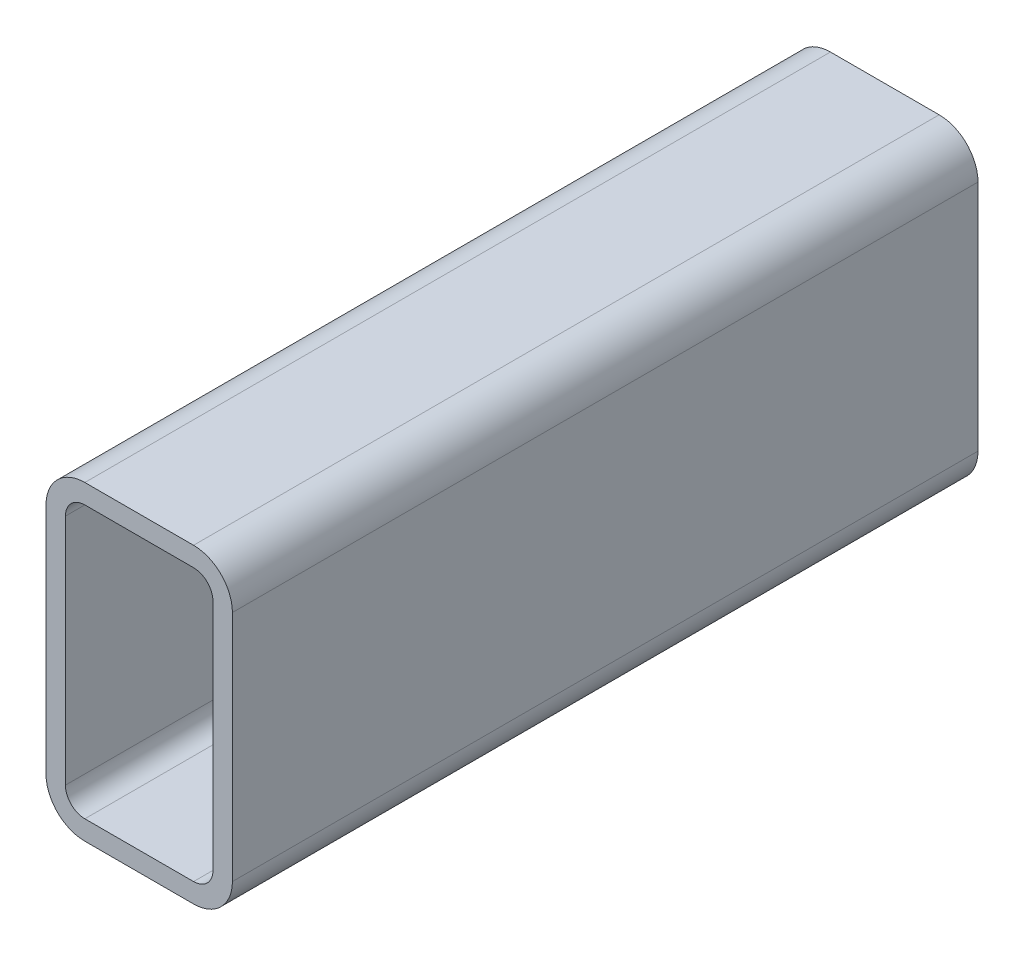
ISO-10303-21;
HEADER;
FILE_DESCRIPTION(('STEP AP214'),'2;1');
FILE_NAME('part.step','',(''),(''),'','','');
FILE_SCHEMA(('AUTOMOTIVE_DESIGN { 1 0 10303 214 1 1 1 1 }'));
ENDSEC;
DATA;
#1=APPLICATION_CONTEXT('core data for automotive mechanical design processes');
#2=APPLICATION_PROTOCOL_DEFINITION('international standard','automotive_design',2000,#1);
#3=PRODUCT_CONTEXT('',#1,'mechanical');
#4=PRODUCT('Part','Part','',(#3));
#5=PRODUCT_RELATED_PRODUCT_CATEGORY('part','',(#4));
#6=PRODUCT_DEFINITION_FORMATION('','',#4);
#7=PRODUCT_DEFINITION_CONTEXT('part definition',#1,'design');
#8=PRODUCT_DEFINITION('design','',#6,#7);
#9=PRODUCT_DEFINITION_SHAPE('','',#8);
#10=(LENGTH_UNIT() NAMED_UNIT(*) SI_UNIT(.MILLI.,.METRE.));
#11=(NAMED_UNIT(*) PLANE_ANGLE_UNIT() SI_UNIT($,.RADIAN.));
#12=(NAMED_UNIT(*) SI_UNIT($,.STERADIAN.) SOLID_ANGLE_UNIT());
#13=UNCERTAINTY_MEASURE_WITH_UNIT(LENGTH_MEASURE(1.E-05),#10,'distance_accuracy_value','');
#14=(GEOMETRIC_REPRESENTATION_CONTEXT(3) GLOBAL_UNCERTAINTY_ASSIGNED_CONTEXT((#13)) GLOBAL_UNIT_ASSIGNED_CONTEXT((#10,
#11,#12)) REPRESENTATION_CONTEXT('',''));
#15=CARTESIAN_POINT('',(0.,0.,0.));
#16=DIRECTION('',(0.,0.,1.));
#17=DIRECTION('',(1.,0.,0.));
#18=AXIS2_PLACEMENT_3D('',#15,#16,#17);
#19=CARTESIAN_POINT('',(18.3641160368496,113.159856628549,304.8));
#20=DIRECTION('',(0.,0.,1.));
#21=DIRECTION('',(1.,0.,0.));
#22=AXIS2_PLACEMENT_3D('',#19,#20,#21);
#23=PLANE('',#22);
#24=CARTESIAN_POINT('',(18.3641160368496,113.159856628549,304.8));
#25=DIRECTION('',(0.,0.,1.));
#26=DIRECTION('',(1.,0.,0.));
#27=AXIS2_PLACEMENT_3D('',#24,#25,#26);
#28=CIRCLE('',#27,15.875);
#29=CARTESIAN_POINT('',(18.3641160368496,129.034856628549,304.8));
#30=VERTEX_POINT('',#29);
#31=CARTESIAN_POINT('',(2.48911603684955,113.159856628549,304.8));
#32=VERTEX_POINT('',#31);
#33=EDGE_CURVE('E211',#30,#32,#28,.T.);
#34=ORIENTED_EDGE('',*,*,#33,.T.);
#35=DIRECTION('',(0.,-1.,0.));
#36=VECTOR('',#35,1.);
#37=CARTESIAN_POINT('',(2.48911603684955,17.9098566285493,304.8));
#38=LINE('',#37,#36);
#39=CARTESIAN_POINT('',(2.48911603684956,17.9098566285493,304.8));
#40=VERTEX_POINT('',#39);
#41=EDGE_CURVE('E214',#32,#40,#38,.T.);
#42=ORIENTED_EDGE('',*,*,#41,.T.);
#43=CARTESIAN_POINT('',(18.3641160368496,17.9098566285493,304.8));
#44=DIRECTION('',(0.,0.,1.));
#45=DIRECTION('',(1.,0.,0.));
#46=AXIS2_PLACEMENT_3D('',#43,#44,#45);
#47=CIRCLE('',#46,15.875);
#48=CARTESIAN_POINT('',(18.3641160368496,2.03485662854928,304.8));
#49=VERTEX_POINT('',#48);
#50=EDGE_CURVE('E217',#40,#49,#47,.T.);
#51=ORIENTED_EDGE('',*,*,#50,.T.);
#52=DIRECTION('',(1.,0.,0.));
#53=VECTOR('',#52,1.);
#54=CARTESIAN_POINT('',(62.8141160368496,2.03485662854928,304.8));
#55=LINE('',#54,#53);
#56=CARTESIAN_POINT('',(62.8141160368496,2.03485662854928,304.8));
#57=VERTEX_POINT('',#56);
#58=EDGE_CURVE('E219',#49,#57,#55,.T.);
#59=ORIENTED_EDGE('',*,*,#58,.T.);
#60=CARTESIAN_POINT('',(62.8141160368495,17.9098566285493,304.8));
#61=DIRECTION('',(0.,0.,1.));
#62=DIRECTION('',(1.,0.,0.));
#63=AXIS2_PLACEMENT_3D('',#60,#61,#62);
#64=CIRCLE('',#63,15.875);
#65=CARTESIAN_POINT('',(78.6891160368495,17.9098566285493,304.8));
#66=VERTEX_POINT('',#65);
#67=EDGE_CURVE('E221',#57,#66,#64,.T.);
#68=ORIENTED_EDGE('',*,*,#67,.T.);
#69=DIRECTION('',(0.,1.,0.));
#70=VECTOR('',#69,1.);
#71=CARTESIAN_POINT('',(78.6891160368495,113.159856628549,304.8));
#72=LINE('',#71,#70);
#73=CARTESIAN_POINT('',(78.6891160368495,113.159856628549,304.8));
#74=VERTEX_POINT('',#73);
#75=EDGE_CURVE('E223',#66,#74,#72,.T.);
#76=ORIENTED_EDGE('',*,*,#75,.T.);
#77=CARTESIAN_POINT('',(62.8141160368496,113.159856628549,304.8));
#78=DIRECTION('',(0.,0.,1.));
#79=DIRECTION('',(1.,0.,0.));
#80=AXIS2_PLACEMENT_3D('',#77,#78,#79);
#81=CIRCLE('',#80,15.875);
#82=CARTESIAN_POINT('',(62.8141160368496,129.034856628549,304.8));
#83=VERTEX_POINT('',#82);
#84=EDGE_CURVE('E225',#74,#83,#81,.T.);
#85=ORIENTED_EDGE('',*,*,#84,.T.);
#86=DIRECTION('',(-1.,0.,0.));
#87=VECTOR('',#86,1.);
#88=CARTESIAN_POINT('',(18.3641160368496,129.034856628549,304.8));
#89=LINE('',#88,#87);
#90=EDGE_CURVE('E227',#83,#30,#89,.T.);
#91=ORIENTED_EDGE('',*,*,#90,.T.);
#92=EDGE_LOOP('',(#34,#42,#51,#59,#68,#76,#85,#91));
#93=FACE_BOUND('',#92,.T.);
#94=DIRECTION('',(0.,-1.,0.));
#95=VECTOR('',#94,1.);
#96=CARTESIAN_POINT('',(10.4266160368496,17.9098566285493,304.8));
#97=LINE('',#96,#95);
#98=CARTESIAN_POINT('',(10.4266160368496,113.159856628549,304.8));
#99=VERTEX_POINT('',#98);
#100=CARTESIAN_POINT('',(10.4266160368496,17.9098566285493,304.8));
#101=VERTEX_POINT('',#100);
#102=EDGE_CURVE('E154',#99,#101,#97,.T.);
#103=ORIENTED_EDGE('',*,*,#102,.F.);
#104=CARTESIAN_POINT('',(18.3641160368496,113.159856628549,304.8));
#105=DIRECTION('',(0.,0.,1.));
#106=DIRECTION('',(1.,0.,0.));
#107=AXIS2_PLACEMENT_3D('',#104,#105,#106);
#108=CIRCLE('',#107,7.93749999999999);
#109=CARTESIAN_POINT('',(18.3641160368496,121.097356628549,304.8));
#110=VERTEX_POINT('',#109);
#111=EDGE_CURVE('E146',#110,#99,#108,.T.);
#112=ORIENTED_EDGE('',*,*,#111,.F.);
#113=DIRECTION('',(-1.,0.,0.));
#114=VECTOR('',#113,1.);
#115=CARTESIAN_POINT('',(18.3641160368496,121.097356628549,304.8));
#116=LINE('',#115,#114);
#117=CARTESIAN_POINT('',(62.8141160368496,121.097356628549,304.8));
#118=VERTEX_POINT('',#117);
#119=EDGE_CURVE('E179',#118,#110,#116,.T.);
#120=ORIENTED_EDGE('',*,*,#119,.F.);
#121=CARTESIAN_POINT('',(62.8141160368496,113.159856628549,304.8));
#122=DIRECTION('',(0.,0.,1.));
#123=DIRECTION('',(1.,0.,0.));
#124=AXIS2_PLACEMENT_3D('',#121,#122,#123);
#125=CIRCLE('',#124,7.93749999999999);
#126=CARTESIAN_POINT('',(70.7516160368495,113.159856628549,304.8));
#127=VERTEX_POINT('',#126);
#128=EDGE_CURVE('E177',#127,#118,#125,.T.);
#129=ORIENTED_EDGE('',*,*,#128,.F.);
#130=DIRECTION('',(0.,1.,0.));
#131=VECTOR('',#130,1.);
#132=CARTESIAN_POINT('',(70.7516160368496,113.159856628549,304.8));
#133=LINE('',#132,#131);
#134=CARTESIAN_POINT('',(70.7516160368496,17.9098566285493,304.8));
#135=VERTEX_POINT('',#134);
#136=EDGE_CURVE('E175',#135,#127,#133,.T.);
#137=ORIENTED_EDGE('',*,*,#136,.F.);
#138=CARTESIAN_POINT('',(62.8141160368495,17.9098566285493,304.8));
#139=DIRECTION('',(0.,0.,1.));
#140=DIRECTION('',(1.,0.,0.));
#141=AXIS2_PLACEMENT_3D('',#138,#139,#140);
#142=CIRCLE('',#141,7.93750000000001);
#143=CARTESIAN_POINT('',(62.8141160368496,9.97235662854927,304.8));
#144=VERTEX_POINT('',#143);
#145=EDGE_CURVE('E173',#144,#135,#142,.T.);
#146=ORIENTED_EDGE('',*,*,#145,.F.);
#147=DIRECTION('',(1.,0.,0.));
#148=VECTOR('',#147,1.);
#149=CARTESIAN_POINT('',(62.8141160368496,9.97235662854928,304.8));
#150=LINE('',#149,#148);
#151=CARTESIAN_POINT('',(18.3641160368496,9.97235662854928,304.8));
#152=VERTEX_POINT('',#151);
#153=EDGE_CURVE('E169',#152,#144,#150,.T.);
#154=ORIENTED_EDGE('',*,*,#153,.F.);
#155=CARTESIAN_POINT('',(18.3641160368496,17.9098566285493,304.8));
#156=DIRECTION('',(0.,0.,1.));
#157=DIRECTION('',(1.,0.,0.));
#158=AXIS2_PLACEMENT_3D('',#155,#156,#157);
#159=CIRCLE('',#158,7.9375);
#160=EDGE_CURVE('E167',#101,#152,#159,.T.);
#161=ORIENTED_EDGE('',*,*,#160,.F.);
#162=EDGE_LOOP('',(#103,#112,#120,#129,#137,#146,#154,#161));
#163=FACE_BOUND('',#162,.T.);
#164=ADVANCED_FACE('F33',(#93,#163),#23,.T.);
#165=CARTESIAN_POINT('',(18.3641160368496,113.159856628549,0.));
#166=DIRECTION('',(0.,0.,1.));
#167=DIRECTION('',(1.,0.,0.));
#168=AXIS2_PLACEMENT_3D('',#165,#166,#167);
#169=PLANE('',#168);
#170=CARTESIAN_POINT('',(18.3641160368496,113.159856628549,0.));
#171=DIRECTION('',(0.,0.,1.));
#172=DIRECTION('',(1.,0.,0.));
#173=AXIS2_PLACEMENT_3D('',#170,#171,#172);
#174=CIRCLE('',#173,15.875);
#175=CARTESIAN_POINT('',(18.3641160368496,129.034856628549,0.));
#176=VERTEX_POINT('',#175);
#177=CARTESIAN_POINT('',(2.48911603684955,113.159856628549,0.));
#178=VERTEX_POINT('',#177);
#179=EDGE_CURVE('E162',#176,#178,#174,.T.);
#180=ORIENTED_EDGE('',*,*,#179,.F.);
#181=DIRECTION('',(-1.,0.,0.));
#182=VECTOR('',#181,1.);
#183=CARTESIAN_POINT('',(18.3641160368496,129.034856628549,0.));
#184=LINE('',#183,#182);
#185=CARTESIAN_POINT('',(62.8141160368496,129.034856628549,0.));
#186=VERTEX_POINT('',#185);
#187=EDGE_CURVE('E215',#186,#176,#184,.T.);
#188=ORIENTED_EDGE('',*,*,#187,.F.);
#189=CARTESIAN_POINT('',(62.8141160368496,113.159856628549,0.));
#190=DIRECTION('',(0.,0.,1.));
#191=DIRECTION('',(1.,0.,0.));
#192=AXIS2_PLACEMENT_3D('',#189,#190,#191);
#193=CIRCLE('',#192,15.875);
#194=CARTESIAN_POINT('',(78.6891160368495,113.159856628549,0.));
#195=VERTEX_POINT('',#194);
#196=EDGE_CURVE('E242',#195,#186,#193,.T.);
#197=ORIENTED_EDGE('',*,*,#196,.F.);
#198=DIRECTION('',(0.,1.,0.));
#199=VECTOR('',#198,1.);
#200=CARTESIAN_POINT('',(78.6891160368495,113.159856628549,0.));
#201=LINE('',#200,#199);
#202=CARTESIAN_POINT('',(78.6891160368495,17.9098566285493,0.));
#203=VERTEX_POINT('',#202);
#204=EDGE_CURVE('E240',#203,#195,#201,.T.);
#205=ORIENTED_EDGE('',*,*,#204,.F.);
#206=CARTESIAN_POINT('',(62.8141160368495,17.9098566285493,0.));
#207=DIRECTION('',(0.,0.,1.));
#208=DIRECTION('',(1.,0.,0.));
#209=AXIS2_PLACEMENT_3D('',#206,#207,#208);
#210=CIRCLE('',#209,15.875);
#211=CARTESIAN_POINT('',(62.8141160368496,2.03485662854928,0.));
#212=VERTEX_POINT('',#211);
#213=EDGE_CURVE('E238',#212,#203,#210,.T.);
#214=ORIENTED_EDGE('',*,*,#213,.F.);
#215=DIRECTION('',(1.,0.,0.));
#216=VECTOR('',#215,1.);
#217=CARTESIAN_POINT('',(62.8141160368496,2.03485662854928,0.));
#218=LINE('',#217,#216);
#219=CARTESIAN_POINT('',(18.3641160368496,2.03485662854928,0.));
#220=VERTEX_POINT('',#219);
#221=EDGE_CURVE('E236',#220,#212,#218,.T.);
#222=ORIENTED_EDGE('',*,*,#221,.F.);
#223=CARTESIAN_POINT('',(18.3641160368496,17.9098566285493,0.));
#224=DIRECTION('',(0.,0.,1.));
#225=DIRECTION('',(1.,0.,0.));
#226=AXIS2_PLACEMENT_3D('',#223,#224,#225);
#227=CIRCLE('',#226,15.875);
#228=CARTESIAN_POINT('',(2.48911603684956,17.9098566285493,0.));
#229=VERTEX_POINT('',#228);
#230=EDGE_CURVE('E234',#229,#220,#227,.T.);
#231=ORIENTED_EDGE('',*,*,#230,.F.);
#232=DIRECTION('',(0.,-1.,0.));
#233=VECTOR('',#232,1.);
#234=CARTESIAN_POINT('',(2.48911603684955,17.9098566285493,0.));
#235=LINE('',#234,#233);
#236=EDGE_CURVE('E232',#178,#229,#235,.T.);
#237=ORIENTED_EDGE('',*,*,#236,.F.);
#238=EDGE_LOOP('',(#180,#188,#197,#205,#214,#222,#231,#237));
#239=FACE_BOUND('',#238,.T.);
#240=CARTESIAN_POINT('',(18.3641160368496,113.159856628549,0.));
#241=DIRECTION('',(0.,0.,1.));
#242=DIRECTION('',(1.,0.,0.));
#243=AXIS2_PLACEMENT_3D('',#240,#241,#242);
#244=CIRCLE('',#243,7.93749999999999);
#245=CARTESIAN_POINT('',(18.3641160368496,121.097356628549,0.));
#246=VERTEX_POINT('',#245);
#247=CARTESIAN_POINT('',(10.4266160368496,113.159856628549,0.));
#248=VERTEX_POINT('',#247);
#249=EDGE_CURVE('E56',#246,#248,#244,.T.);
#250=ORIENTED_EDGE('',*,*,#249,.T.);
#251=DIRECTION('',(0.,-1.,0.));
#252=VECTOR('',#251,1.);
#253=CARTESIAN_POINT('',(10.4266160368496,17.9098566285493,0.));
#254=LINE('',#253,#252);
#255=CARTESIAN_POINT('',(10.4266160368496,17.9098566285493,0.));
#256=VERTEX_POINT('',#255);
#257=EDGE_CURVE('E161',#248,#256,#254,.T.);
#258=ORIENTED_EDGE('',*,*,#257,.T.);
#259=CARTESIAN_POINT('',(18.3641160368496,17.9098566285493,0.));
#260=DIRECTION('',(0.,0.,1.));
#261=DIRECTION('',(1.,0.,0.));
#262=AXIS2_PLACEMENT_3D('',#259,#260,#261);
#263=CIRCLE('',#262,7.9375);
#264=CARTESIAN_POINT('',(18.3641160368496,9.97235662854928,0.));
#265=VERTEX_POINT('',#264);
#266=EDGE_CURVE('E183',#256,#265,#263,.T.);
#267=ORIENTED_EDGE('',*,*,#266,.T.);
#268=DIRECTION('',(1.,0.,0.));
#269=VECTOR('',#268,1.);
#270=CARTESIAN_POINT('',(62.8141160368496,9.97235662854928,0.));
#271=LINE('',#270,#269);
#272=CARTESIAN_POINT('',(62.8141160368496,9.97235662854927,0.));
#273=VERTEX_POINT('',#272);
#274=EDGE_CURVE('E186',#265,#273,#271,.T.);
#275=ORIENTED_EDGE('',*,*,#274,.T.);
#276=CARTESIAN_POINT('',(62.8141160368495,17.9098566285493,0.));
#277=DIRECTION('',(0.,0.,1.));
#278=DIRECTION('',(1.,0.,0.));
#279=AXIS2_PLACEMENT_3D('',#276,#277,#278);
#280=CIRCLE('',#279,7.93750000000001);
#281=CARTESIAN_POINT('',(70.7516160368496,17.9098566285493,0.));
#282=VERTEX_POINT('',#281);
#283=EDGE_CURVE('E189',#273,#282,#280,.T.);
#284=ORIENTED_EDGE('',*,*,#283,.T.);
#285=DIRECTION('',(0.,1.,0.));
#286=VECTOR('',#285,1.);
#287=CARTESIAN_POINT('',(70.7516160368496,113.159856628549,0.));
#288=LINE('',#287,#286);
#289=CARTESIAN_POINT('',(70.7516160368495,113.159856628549,0.));
#290=VERTEX_POINT('',#289);
#291=EDGE_CURVE('E192',#282,#290,#288,.T.);
#292=ORIENTED_EDGE('',*,*,#291,.T.);
#293=CARTESIAN_POINT('',(62.8141160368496,113.159856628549,0.));
#294=DIRECTION('',(0.,0.,1.));
#295=DIRECTION('',(1.,0.,0.));
#296=AXIS2_PLACEMENT_3D('',#293,#294,#295);
#297=CIRCLE('',#296,7.93749999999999);
#298=CARTESIAN_POINT('',(62.8141160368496,121.097356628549,0.));
#299=VERTEX_POINT('',#298);
#300=EDGE_CURVE('E195',#290,#299,#297,.T.);
#301=ORIENTED_EDGE('',*,*,#300,.T.);
#302=DIRECTION('',(-1.,0.,0.));
#303=VECTOR('',#302,1.);
#304=CARTESIAN_POINT('',(18.3641160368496,121.097356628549,0.));
#305=LINE('',#304,#303);
#306=EDGE_CURVE('E155',#299,#246,#305,.T.);
#307=ORIENTED_EDGE('',*,*,#306,.T.);
#308=EDGE_LOOP('',(#250,#258,#267,#275,#284,#292,#301,#307));
#309=FACE_BOUND('',#308,.T.);
#310=ADVANCED_FACE('F272',(#239,#309),#169,.F.);
#311=CARTESIAN_POINT('',(18.3641160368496,113.159856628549,304.8));
#312=DIRECTION('',(0.,0.,-1.));
#313=DIRECTION('',(-1.,0.,0.));
#314=AXIS2_PLACEMENT_3D('',#311,#312,#313);
#315=CYLINDRICAL_SURFACE('',#314,15.875);
#316=ORIENTED_EDGE('',*,*,#179,.T.);
#317=DIRECTION('',(0.,0.,-1.));
#318=VECTOR('',#317,1.);
#319=CARTESIAN_POINT('',(2.48911603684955,113.159856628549,304.8));
#320=LINE('',#319,#318);
#321=EDGE_CURVE('E11',#32,#178,#320,.T.);
#322=ORIENTED_EDGE('',*,*,#321,.F.);
#323=ORIENTED_EDGE('',*,*,#33,.F.);
#324=DIRECTION('',(0.,0.,-1.));
#325=VECTOR('',#324,1.);
#326=CARTESIAN_POINT('',(18.3641160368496,129.034856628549,304.8));
#327=LINE('',#326,#325);
#328=EDGE_CURVE('E229',#30,#176,#327,.T.);
#329=ORIENTED_EDGE('',*,*,#328,.T.);
#330=EDGE_LOOP('',(#316,#322,#323,#329));
#331=FACE_BOUND('',#330,.T.);
#332=ADVANCED_FACE('F35',(#331),#315,.T.);
#333=CARTESIAN_POINT('',(2.48911603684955,17.9098566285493,304.8));
#334=DIRECTION('',(1.,0.,0.));
#335=DIRECTION('',(0.,0.,-1.));
#336=AXIS2_PLACEMENT_3D('',#333,#334,#335);
#337=PLANE('',#336);
#338=ORIENTED_EDGE('',*,*,#236,.T.);
#339=DIRECTION('',(0.,0.,-1.));
#340=VECTOR('',#339,1.);
#341=CARTESIAN_POINT('',(2.48911603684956,17.9098566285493,304.8));
#342=LINE('',#341,#340);
#343=EDGE_CURVE('E41',#40,#229,#342,.T.);
#344=ORIENTED_EDGE('',*,*,#343,.F.);
#345=ORIENTED_EDGE('',*,*,#41,.F.);
#346=ORIENTED_EDGE('',*,*,#321,.T.);
#347=EDGE_LOOP('',(#338,#344,#345,#346));
#348=FACE_BOUND('',#347,.T.);
#349=ADVANCED_FACE('F289',(#348),#337,.F.);
#350=CARTESIAN_POINT('',(18.3641160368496,17.9098566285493,304.8));
#351=DIRECTION('',(0.,0.,-1.));
#352=DIRECTION('',(-1.,0.,0.));
#353=AXIS2_PLACEMENT_3D('',#350,#351,#352);
#354=CYLINDRICAL_SURFACE('',#353,15.875);
#355=ORIENTED_EDGE('',*,*,#230,.T.);
#356=DIRECTION('',(0.,0.,-1.));
#357=VECTOR('',#356,1.);
#358=CARTESIAN_POINT('',(18.3641160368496,2.03485662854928,304.8));
#359=LINE('',#358,#357);
#360=EDGE_CURVE('E259',#49,#220,#359,.T.);
#361=ORIENTED_EDGE('',*,*,#360,.F.);
#362=ORIENTED_EDGE('',*,*,#50,.F.);
#363=ORIENTED_EDGE('',*,*,#343,.T.);
#364=EDGE_LOOP('',(#355,#361,#362,#363));
#365=FACE_BOUND('',#364,.T.);
#366=ADVANCED_FACE('F266',(#365),#354,.T.);
#367=CARTESIAN_POINT('',(62.8141160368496,2.03485662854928,304.8));
#368=DIRECTION('',(0.,1.,0.));
#369=DIRECTION('',(0.,0.,1.));
#370=AXIS2_PLACEMENT_3D('',#367,#368,#369);
#371=PLANE('',#370);
#372=ORIENTED_EDGE('',*,*,#221,.T.);
#373=DIRECTION('',(0.,0.,-1.));
#374=VECTOR('',#373,1.);
#375=CARTESIAN_POINT('',(62.8141160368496,2.03485662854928,304.8));
#376=LINE('',#375,#374);
#377=EDGE_CURVE('E256',#57,#212,#376,.T.);
#378=ORIENTED_EDGE('',*,*,#377,.F.);
#379=ORIENTED_EDGE('',*,*,#58,.F.);
#380=ORIENTED_EDGE('',*,*,#360,.T.);
#381=EDGE_LOOP('',(#372,#378,#379,#380));
#382=FACE_BOUND('',#381,.T.);
#383=ADVANCED_FACE('F278',(#382),#371,.F.);
#384=CARTESIAN_POINT('',(62.8141160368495,17.9098566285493,304.8));
#385=DIRECTION('',(0.,0.,-1.));
#386=DIRECTION('',(-1.,0.,0.));
#387=AXIS2_PLACEMENT_3D('',#384,#385,#386);
#388=CYLINDRICAL_SURFACE('',#387,15.875);
#389=ORIENTED_EDGE('',*,*,#213,.T.);
#390=DIRECTION('',(0.,0.,-1.));
#391=VECTOR('',#390,1.);
#392=CARTESIAN_POINT('',(78.6891160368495,17.9098566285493,304.8));
#393=LINE('',#392,#391);
#394=EDGE_CURVE('E253',#66,#203,#393,.T.);
#395=ORIENTED_EDGE('',*,*,#394,.F.);
#396=ORIENTED_EDGE('',*,*,#67,.F.);
#397=ORIENTED_EDGE('',*,*,#377,.T.);
#398=EDGE_LOOP('',(#389,#395,#396,#397));
#399=FACE_BOUND('',#398,.T.);
#400=ADVANCED_FACE('F282',(#399),#388,.T.);
#401=CARTESIAN_POINT('',(78.6891160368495,113.159856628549,304.8));
#402=DIRECTION('',(-1.,0.,0.));
#403=DIRECTION('',(0.,0.,1.));
#404=AXIS2_PLACEMENT_3D('',#401,#402,#403);
#405=PLANE('',#404);
#406=ORIENTED_EDGE('',*,*,#204,.T.);
#407=DIRECTION('',(0.,0.,-1.));
#408=VECTOR('',#407,1.);
#409=CARTESIAN_POINT('',(78.6891160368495,113.159856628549,304.8));
#410=LINE('',#409,#408);
#411=EDGE_CURVE('E250',#74,#195,#410,.T.);
#412=ORIENTED_EDGE('',*,*,#411,.F.);
#413=ORIENTED_EDGE('',*,*,#75,.F.);
#414=ORIENTED_EDGE('',*,*,#394,.T.);
#415=EDGE_LOOP('',(#406,#412,#413,#414));
#416=FACE_BOUND('',#415,.T.);
#417=ADVANCED_FACE('F302',(#416),#405,.F.);
#418=CARTESIAN_POINT('',(62.8141160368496,113.159856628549,304.8));
#419=DIRECTION('',(0.,0.,-1.));
#420=DIRECTION('',(-1.,0.,0.));
#421=AXIS2_PLACEMENT_3D('',#418,#419,#420);
#422=CYLINDRICAL_SURFACE('',#421,15.875);
#423=ORIENTED_EDGE('',*,*,#196,.T.);
#424=DIRECTION('',(0.,0.,-1.));
#425=VECTOR('',#424,1.);
#426=CARTESIAN_POINT('',(62.8141160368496,129.034856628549,304.8));
#427=LINE('',#426,#425);
#428=EDGE_CURVE('E247',#83,#186,#427,.T.);
#429=ORIENTED_EDGE('',*,*,#428,.F.);
#430=ORIENTED_EDGE('',*,*,#84,.F.);
#431=ORIENTED_EDGE('',*,*,#411,.T.);
#432=EDGE_LOOP('',(#423,#429,#430,#431));
#433=FACE_BOUND('',#432,.T.);
#434=ADVANCED_FACE('F300',(#433),#422,.T.);
#435=CARTESIAN_POINT('',(18.3641160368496,129.034856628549,304.8));
#436=DIRECTION('',(0.,-1.,0.));
#437=DIRECTION('',(0.,0.,-1.));
#438=AXIS2_PLACEMENT_3D('',#435,#436,#437);
#439=PLANE('',#438);
#440=ORIENTED_EDGE('',*,*,#187,.T.);
#441=ORIENTED_EDGE('',*,*,#328,.F.);
#442=ORIENTED_EDGE('',*,*,#90,.F.);
#443=ORIENTED_EDGE('',*,*,#428,.T.);
#444=EDGE_LOOP('',(#440,#441,#442,#443));
#445=FACE_BOUND('',#444,.T.);
#446=ADVANCED_FACE('F295',(#445),#439,.F.);
#447=CARTESIAN_POINT('',(18.3641160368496,113.159856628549,304.8));
#448=DIRECTION('',(0.,0.,-1.));
#449=DIRECTION('',(-1.,0.,0.));
#450=AXIS2_PLACEMENT_3D('',#447,#448,#449);
#451=CYLINDRICAL_SURFACE('',#450,7.93749999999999);
#452=ORIENTED_EDGE('',*,*,#249,.F.);
#453=DIRECTION('',(0.,0.,-1.));
#454=VECTOR('',#453,1.);
#455=CARTESIAN_POINT('',(18.3641160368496,121.097356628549,304.8));
#456=LINE('',#455,#454);
#457=EDGE_CURVE('E150',#110,#246,#456,.T.);
#458=ORIENTED_EDGE('',*,*,#457,.F.);
#459=ORIENTED_EDGE('',*,*,#111,.T.);
#460=DIRECTION('',(0.,0.,-1.));
#461=VECTOR('',#460,1.);
#462=CARTESIAN_POINT('',(10.4266160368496,113.159856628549,304.8));
#463=LINE('',#462,#461);
#464=EDGE_CURVE('E149',#99,#248,#463,.T.);
#465=ORIENTED_EDGE('',*,*,#464,.T.);
#466=EDGE_LOOP('',(#452,#458,#459,#465));
#467=FACE_BOUND('',#466,.T.);
#468=ADVANCED_FACE('F148',(#467),#451,.F.);
#469=CARTESIAN_POINT('',(10.4266160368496,17.9098566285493,304.8));
#470=DIRECTION('',(1.,0.,0.));
#471=DIRECTION('',(0.,0.,-1.));
#472=AXIS2_PLACEMENT_3D('',#469,#470,#471);
#473=PLANE('',#472);
#474=ORIENTED_EDGE('',*,*,#257,.F.);
#475=ORIENTED_EDGE('',*,*,#464,.F.);
#476=ORIENTED_EDGE('',*,*,#102,.T.);
#477=DIRECTION('',(0.,0.,-1.));
#478=VECTOR('',#477,1.);
#479=CARTESIAN_POINT('',(10.4266160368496,17.9098566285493,304.8));
#480=LINE('',#479,#478);
#481=EDGE_CURVE('E163',#101,#256,#480,.T.);
#482=ORIENTED_EDGE('',*,*,#481,.T.);
#483=EDGE_LOOP('',(#474,#475,#476,#482));
#484=FACE_BOUND('',#483,.T.);
#485=ADVANCED_FACE('F158',(#484),#473,.T.);
#486=CARTESIAN_POINT('',(18.3641160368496,17.9098566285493,304.8));
#487=DIRECTION('',(0.,0.,-1.));
#488=DIRECTION('',(-1.,0.,0.));
#489=AXIS2_PLACEMENT_3D('',#486,#487,#488);
#490=CYLINDRICAL_SURFACE('',#489,7.9375);
#491=ORIENTED_EDGE('',*,*,#266,.F.);
#492=ORIENTED_EDGE('',*,*,#481,.F.);
#493=ORIENTED_EDGE('',*,*,#160,.T.);
#494=DIRECTION('',(0.,0.,-1.));
#495=VECTOR('',#494,1.);
#496=CARTESIAN_POINT('',(18.3641160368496,9.97235662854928,304.8));
#497=LINE('',#496,#495);
#498=EDGE_CURVE('E208',#152,#265,#497,.T.);
#499=ORIENTED_EDGE('',*,*,#498,.T.);
#500=EDGE_LOOP('',(#491,#492,#493,#499));
#501=FACE_BOUND('',#500,.T.);
#502=ADVANCED_FACE('F327',(#501),#490,.F.);
#503=CARTESIAN_POINT('',(62.8141160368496,9.97235662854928,304.8));
#504=DIRECTION('',(0.,1.,0.));
#505=DIRECTION('',(0.,0.,1.));
#506=AXIS2_PLACEMENT_3D('',#503,#504,#505);
#507=PLANE('',#506);
#508=ORIENTED_EDGE('',*,*,#274,.F.);
#509=ORIENTED_EDGE('',*,*,#498,.F.);
#510=ORIENTED_EDGE('',*,*,#153,.T.);
#511=DIRECTION('',(0.,0.,-1.));
#512=VECTOR('',#511,1.);
#513=CARTESIAN_POINT('',(62.8141160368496,9.97235662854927,304.8));
#514=LINE('',#513,#512);
#515=EDGE_CURVE('E206',#144,#273,#514,.T.);
#516=ORIENTED_EDGE('',*,*,#515,.T.);
#517=EDGE_LOOP('',(#508,#509,#510,#516));
#518=FACE_BOUND('',#517,.T.);
#519=ADVANCED_FACE('F331',(#518),#507,.T.);
#520=CARTESIAN_POINT('',(62.8141160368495,17.9098566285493,304.8));
#521=DIRECTION('',(0.,0.,-1.));
#522=DIRECTION('',(-1.,0.,0.));
#523=AXIS2_PLACEMENT_3D('',#520,#521,#522);
#524=CYLINDRICAL_SURFACE('',#523,7.93750000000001);
#525=ORIENTED_EDGE('',*,*,#283,.F.);
#526=ORIENTED_EDGE('',*,*,#515,.F.);
#527=ORIENTED_EDGE('',*,*,#145,.T.);
#528=DIRECTION('',(0.,0.,-1.));
#529=VECTOR('',#528,1.);
#530=CARTESIAN_POINT('',(70.7516160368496,17.9098566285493,304.8));
#531=LINE('',#530,#529);
#532=EDGE_CURVE('E204',#135,#282,#531,.T.);
#533=ORIENTED_EDGE('',*,*,#532,.T.);
#534=EDGE_LOOP('',(#525,#526,#527,#533));
#535=FACE_BOUND('',#534,.T.);
#536=ADVANCED_FACE('F337',(#535),#524,.F.);
#537=CARTESIAN_POINT('',(70.7516160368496,113.159856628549,304.8));
#538=DIRECTION('',(-1.,0.,0.));
#539=DIRECTION('',(0.,0.,1.));
#540=AXIS2_PLACEMENT_3D('',#537,#538,#539);
#541=PLANE('',#540);
#542=ORIENTED_EDGE('',*,*,#291,.F.);
#543=ORIENTED_EDGE('',*,*,#532,.F.);
#544=ORIENTED_EDGE('',*,*,#136,.T.);
#545=DIRECTION('',(0.,0.,-1.));
#546=VECTOR('',#545,1.);
#547=CARTESIAN_POINT('',(70.7516160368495,113.159856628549,304.8));
#548=LINE('',#547,#546);
#549=EDGE_CURVE('E202',#127,#290,#548,.T.);
#550=ORIENTED_EDGE('',*,*,#549,.T.);
#551=EDGE_LOOP('',(#542,#543,#544,#550));
#552=FACE_BOUND('',#551,.T.);
#553=ADVANCED_FACE('F341',(#552),#541,.T.);
#554=CARTESIAN_POINT('',(62.8141160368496,113.159856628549,304.8));
#555=DIRECTION('',(0.,0.,-1.));
#556=DIRECTION('',(-1.,0.,0.));
#557=AXIS2_PLACEMENT_3D('',#554,#555,#556);
#558=CYLINDRICAL_SURFACE('',#557,7.93749999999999);
#559=ORIENTED_EDGE('',*,*,#300,.F.);
#560=ORIENTED_EDGE('',*,*,#549,.F.);
#561=ORIENTED_EDGE('',*,*,#128,.T.);
#562=DIRECTION('',(0.,0.,-1.));
#563=VECTOR('',#562,1.);
#564=CARTESIAN_POINT('',(62.8141160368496,121.097356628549,304.8));
#565=LINE('',#564,#563);
#566=EDGE_CURVE('E48',#118,#299,#565,.T.);
#567=ORIENTED_EDGE('',*,*,#566,.T.);
#568=EDGE_LOOP('',(#559,#560,#561,#567));
#569=FACE_BOUND('',#568,.T.);
#570=ADVANCED_FACE('F345',(#569),#558,.F.);
#571=CARTESIAN_POINT('',(18.3641160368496,121.097356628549,304.8));
#572=DIRECTION('',(0.,-1.,0.));
#573=DIRECTION('',(0.,0.,-1.));
#574=AXIS2_PLACEMENT_3D('',#571,#572,#573);
#575=PLANE('',#574);
#576=ORIENTED_EDGE('',*,*,#306,.F.);
#577=ORIENTED_EDGE('',*,*,#566,.F.);
#578=ORIENTED_EDGE('',*,*,#119,.T.);
#579=ORIENTED_EDGE('',*,*,#457,.T.);
#580=EDGE_LOOP('',(#576,#577,#578,#579));
#581=FACE_BOUND('',#580,.T.);
#582=ADVANCED_FACE('F349',(#581),#575,.T.);
#583=CLOSED_SHELL('',(#164,#310,#332,#349,#366,#383,#400,#417,#434,#446,#468,#485,#502,#519,
#536,#553,#570,#582));
#584=MANIFOLD_SOLID_BREP('B2',#583);
#585=ADVANCED_BREP_SHAPE_REPRESENTATION('',(#18,#584),#14);
#586=SHAPE_DEFINITION_REPRESENTATION(#9,#585);
ENDSEC;
END-ISO-10303-21;
